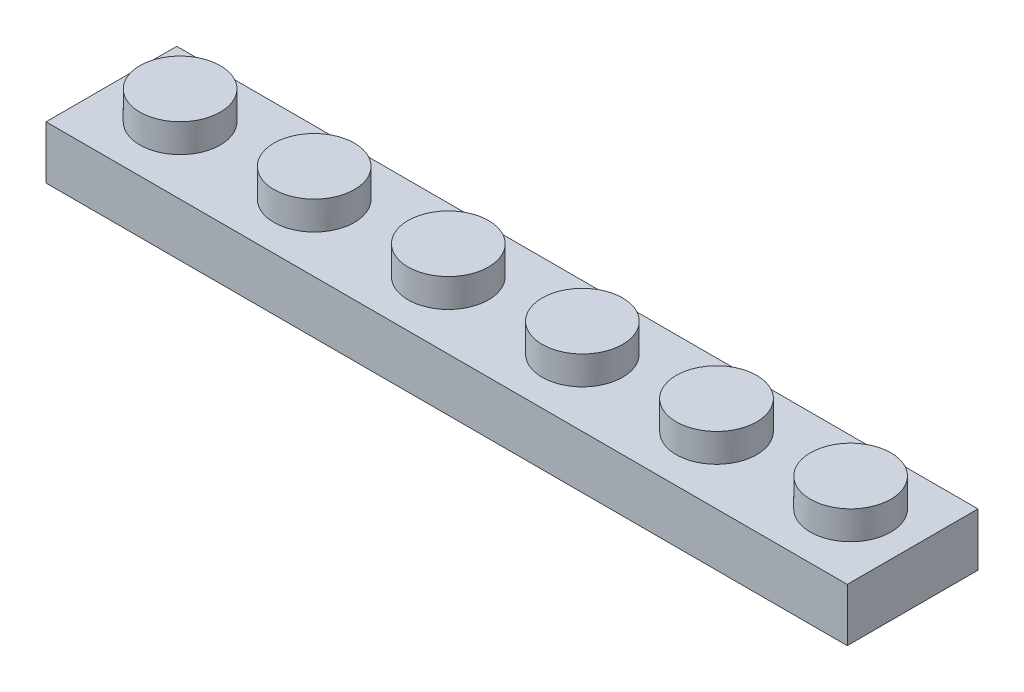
from build123d import *

# Parameters (mm, degrees)
SKETCH1_W       = 47.8
SKETCH1_H       = 7.8
EXTRUDE1_DEPTH  = 3.166
SKETCH2_R       = 2.4
EXTRUDE2_DEPTH  = 1.7
SKETCH3_W       = 4.8
SKETCH3_H       = 4.8
EXTRUDE3_DEPTH  = 1.8
LPATTERN1_COUNT = 6
LPATTERN1_PITCH = 8
LPATTERN2_COUNT = 6
LPATTERN2_PITCH = 8


with BuildPart() as part:
    # Sketch1 → Extrude1 (new body)
    with BuildSketch(Plane(origin=(0, 0, 0), x_dir=(1, 0, 0), z_dir=(0, 1, 0))):
        with Locations((23.9, 3.9)):
            Rectangle(SKETCH1_W, SKETCH1_H)
    extrude(amount=EXTRUDE1_DEPTH)

    # Sketch2 → Extrude2 (add)
    with BuildSketch(Plane(origin=(0, 3.166, 0), x_dir=(1, 0, 0), z_dir=(0, 1, 0))):
        with Locations(Location((4, 4, 0), (0, 0, 90))):
            Circle(SKETCH2_R)
    extrude2 = extrude(amount=EXTRUDE2_DEPTH)

    # Sketch3 → Extrude3 (cut)
    with BuildSketch(Plane.XZ):
        with Locations((43.95, -3.95)):
            Rectangle(SKETCH3_W, SKETCH3_H)
    extrude3 = extrude(amount=-EXTRUDE3_DEPTH, mode=Mode.SUBTRACT)

    # LPattern1: Extrude2 ×6
    with Locations(*[(i * LPATTERN1_PITCH, 0, 0) for i in range(1, LPATTERN1_COUNT)]):
        add(extrude2)

    # LPattern2: Extrude3 ×6
    with Locations(*[(-i * LPATTERN2_PITCH, 0, 0) for i in range(1, LPATTERN2_COUNT)]):
        add(extrude3, mode=Mode.SUBTRACT)


solid = part.part
